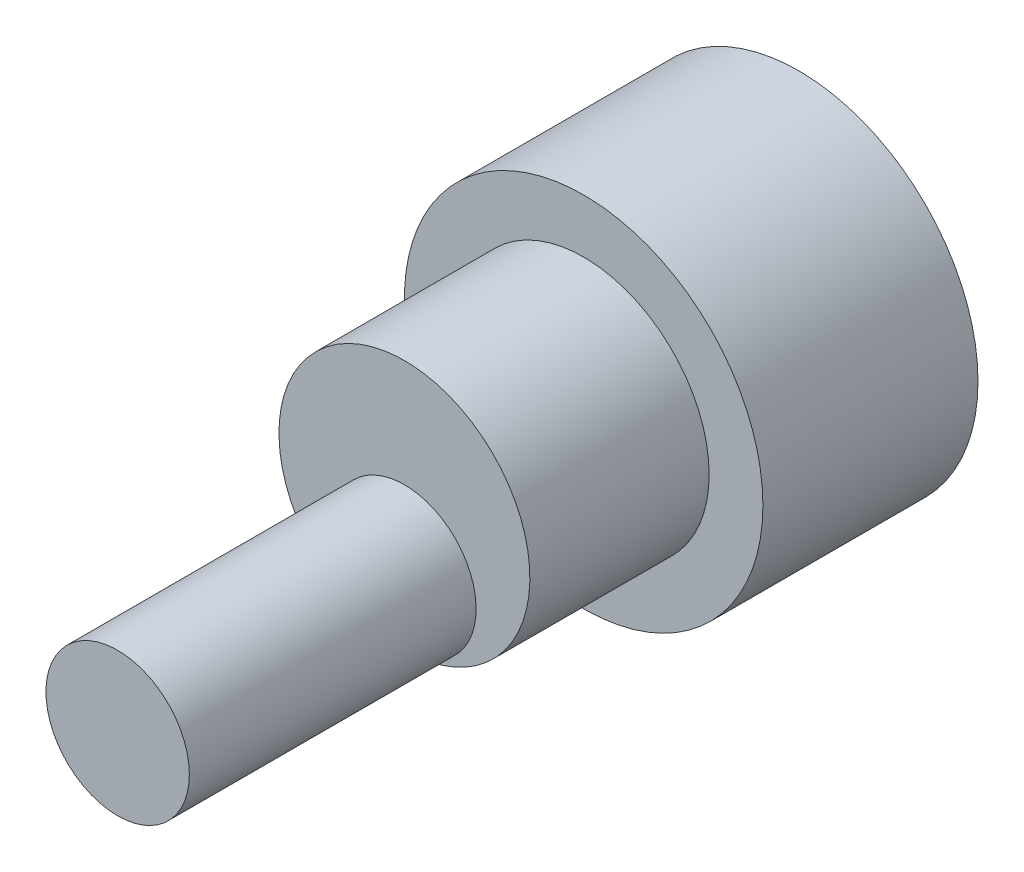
from build123d import *

# Parameters (mm, degrees)
SKETCH_1_R      = 50
EXTRUDE_1_DEPTH = 60
SKETCH_2_R      = 35
EXTRUDE_2_DEPTH = 50
SKETCH_3_R      = 20
EXTRUDE_3_DEPTH = 80


with BuildPart() as part:
    # Sketch 1 → Extrude 1 (new body)
    with BuildSketch(Plane.XY):
        Circle(SKETCH_1_R)
    extrude(amount=EXTRUDE_1_DEPTH)

    # Sketch 2 → Extrude 2 (add)
    with BuildSketch(Plane.XY.offset(60)):
        Circle(SKETCH_2_R)
    extrude(amount=EXTRUDE_2_DEPTH)

    # Sketch 3 → Extrude 3 (add)
    with BuildSketch(Plane.XY.offset(110)):
        with Locations(Location((0, -15, 0), (0, 0, 270))):
            Circle(SKETCH_3_R)
    extrude(amount=EXTRUDE_3_DEPTH)


solid = part.part
